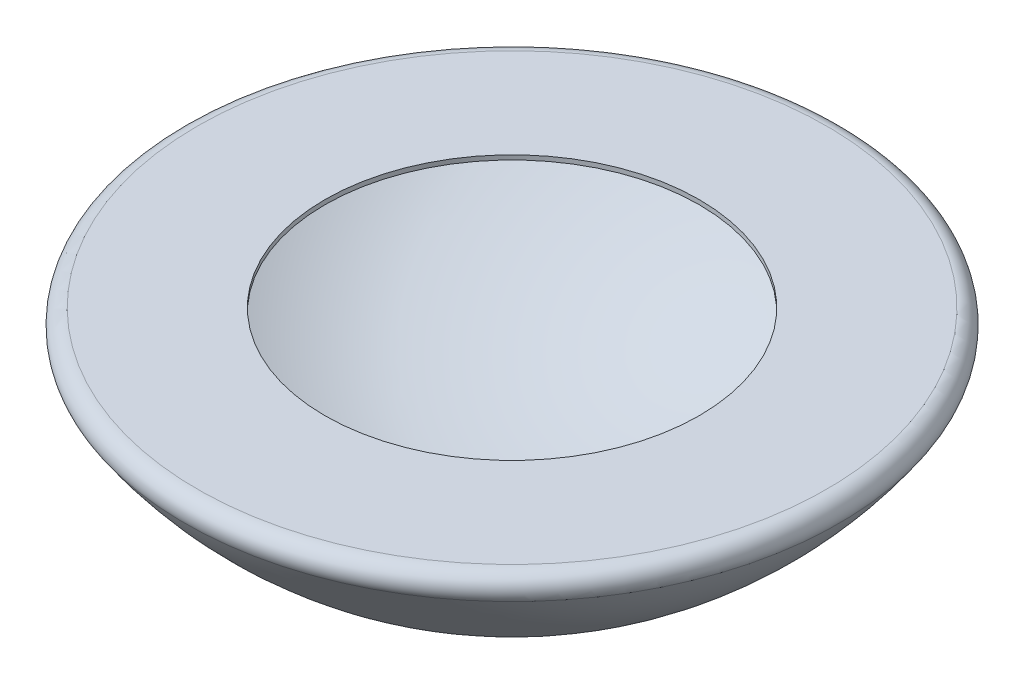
ISO-10303-21;
HEADER;
FILE_DESCRIPTION(('STEP AP214'),'2;1');
FILE_NAME('part.step','',(''),(''),'','','');
FILE_SCHEMA(('AUTOMOTIVE_DESIGN { 1 0 10303 214 1 1 1 1 }'));
ENDSEC;
DATA;
#1=APPLICATION_CONTEXT('core data for automotive mechanical design processes');
#2=APPLICATION_PROTOCOL_DEFINITION('international standard','automotive_design',2000,#1);
#3=PRODUCT_CONTEXT('',#1,'mechanical');
#4=PRODUCT('Part','Part','',(#3));
#5=PRODUCT_RELATED_PRODUCT_CATEGORY('part','',(#4));
#6=PRODUCT_DEFINITION_FORMATION('','',#4);
#7=PRODUCT_DEFINITION_CONTEXT('part definition',#1,'design');
#8=PRODUCT_DEFINITION('design','',#6,#7);
#9=PRODUCT_DEFINITION_SHAPE('','',#8);
#10=(LENGTH_UNIT() NAMED_UNIT(*) SI_UNIT(.MILLI.,.METRE.));
#11=(NAMED_UNIT(*) PLANE_ANGLE_UNIT() SI_UNIT($,.RADIAN.));
#12=(NAMED_UNIT(*) SI_UNIT($,.STERADIAN.) SOLID_ANGLE_UNIT());
#13=UNCERTAINTY_MEASURE_WITH_UNIT(LENGTH_MEASURE(1.E-05),#10,'distance_accuracy_value','');
#14=(GEOMETRIC_REPRESENTATION_CONTEXT(3) GLOBAL_UNCERTAINTY_ASSIGNED_CONTEXT((#13)) GLOBAL_UNIT_ASSIGNED_CONTEXT((#10,
#11,#12)) REPRESENTATION_CONTEXT('',''));
#15=CARTESIAN_POINT('',(0.,0.,0.));
#16=DIRECTION('',(0.,0.,1.));
#17=DIRECTION('',(1.,0.,0.));
#18=AXIS2_PLACEMENT_3D('',#15,#16,#17);
#19=CARTESIAN_POINT('',(-0.28661705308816,12.9984201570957,0.));
#20=DIRECTION('',(0.,0.,-1.));
#21=DIRECTION('',(-1.,0.,0.));
#22=AXIS2_PLACEMENT_3D('',#19,#20,#21);
#23=CIRCLE('',#22,25.7);
#24=TRIMMED_CURVE('',#23,(PARAMETER_VALUE(-1.58194897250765)),
(PARAMETER_VALUE(1.58194897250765)),.T.,.PARAMETER.);
#25=CARTESIAN_POINT('',(0.,12.9984201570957,0.));
#26=DIRECTION('',(0.,1.,0.));
#27=AXIS1_PLACEMENT('',#25,#26);
#28=SURFACE_OF_REVOLUTION('',#24,#27);
#29=CARTESIAN_POINT('',(0.,-12.6999815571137,0.));
#30=VERTEX_POINT('',#29);
#31=VERTEX_LOOP('',#30);
#32=FACE_BOUND('',#31,.T.);
#33=CARTESIAN_POINT('',(0.,-1.3919557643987,0.));
#34=DIRECTION('',(0.,1.,0.));
#35=DIRECTION('',(-1.,0.,0.));
#36=AXIS2_PLACEMENT_3D('',#33,#34,#35);
#37=CIRCLE('',#36,21.5799747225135);
#38=CARTESIAN_POINT('',(-21.5799747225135,-1.3919557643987,0.));
#39=VERTEX_POINT('',#38);
#40=EDGE_CURVE('E49',#39,#39,#37,.T.);
#41=ORIENTED_EDGE('',*,*,#40,.T.);
#42=EDGE_LOOP('',(#41));
#43=FACE_BOUND('',#42,.T.);
#44=ADVANCED_FACE('F31',(#32,#43),#28,.F.);
#45=CARTESIAN_POINT('',(-0.28661705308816,12.9984201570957,0.));
#46=DIRECTION('',(0.,0.,-1.));
#47=DIRECTION('',(-1.,0.,0.));
#48=AXIS2_PLACEMENT_3D('',#45,#46,#47);
#49=CIRCLE('',#48,26.);
#50=TRIMMED_CURVE('',#49,(PARAMETER_VALUE(-1.58182028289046)),
(PARAMETER_VALUE(1.58182028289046)),.T.,.PARAMETER.);
#51=CARTESIAN_POINT('',(0.,12.9984201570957,0.));
#52=DIRECTION('',(0.,1.,0.));
#53=AXIS1_PLACEMENT('',#51,#52);
#54=SURFACE_OF_REVOLUTION('',#50,#53);
#55=CARTESIAN_POINT('',(0.,-1.55993680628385,0.));
#56=DIRECTION('',(0.,1.,0.));
#57=DIRECTION('',(-1.,0.,0.));
#58=AXIS2_PLACEMENT_3D('',#55,#56,#57);
#59=CIRCLE('',#58,21.8285353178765);
#60=CARTESIAN_POINT('',(-21.8285353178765,-1.55993680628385,0.));
#61=VERTEX_POINT('',#60);
#62=EDGE_CURVE('E11',#61,#61,#59,.T.);
#63=ORIENTED_EDGE('',*,*,#62,.F.);
#64=EDGE_LOOP('',(#63));
#65=FACE_BOUND('',#64,.T.);
#66=CARTESIAN_POINT('',(0.,-13.,0.));
#67=VERTEX_POINT('',#66);
#68=VERTEX_LOOP('',#67);
#69=FACE_BOUND('',#68,.T.);
#70=ADVANCED_FACE('F46',(#65,#69),#54,.T.);
#71=CARTESIAN_POINT('',(0.,-1.,0.));
#72=DIRECTION('',(0.,1.,0.));
#73=DIRECTION('',(-1.,0.,0.));
#74=AXIS2_PLACEMENT_3D('',#71,#72,#73);
#75=TOROIDAL_SURFACE('',#74,21.,1.);
#76=CARTESIAN_POINT('',(0.,0.,0.));
#77=DIRECTION('',(0.,1.,0.));
#78=DIRECTION('',(-1.,0.,0.));
#79=AXIS2_PLACEMENT_3D('',#76,#77,#78);
#80=CIRCLE('',#79,21.);
#81=CARTESIAN_POINT('',(-21.,0.,0.));
#82=VERTEX_POINT('',#81);
#83=EDGE_CURVE('E38',#82,#82,#80,.T.);
#84=ORIENTED_EDGE('',*,*,#83,.F.);
#85=EDGE_LOOP('',(#84));
#86=FACE_BOUND('',#85,.T.);
#87=ORIENTED_EDGE('',*,*,#62,.T.);
#88=EDGE_LOOP('',(#87));
#89=FACE_BOUND('',#88,.T.);
#90=ADVANCED_FACE('F66',(#86,#89),#75,.T.);
#91=CARTESIAN_POINT('',(21.,0.,0.));
#92=DIRECTION('',(0.,-1.,0.));
#93=DIRECTION('',(1.,0.,0.));
#94=AXIS2_PLACEMENT_3D('',#91,#92,#93);
#95=PLANE('',#94);
#96=CARTESIAN_POINT('',(0.,0.,0.));
#97=DIRECTION('',(0.,1.,0.));
#98=DIRECTION('',(-1.,0.,0.));
#99=AXIS2_PLACEMENT_3D('',#96,#97,#98);
#100=CIRCLE('',#99,12.4950429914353);
#101=CARTESIAN_POINT('',(-12.4950429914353,0.,0.));
#102=VERTEX_POINT('',#101);
#103=EDGE_CURVE('E59',#102,#102,#100,.T.);
#104=ORIENTED_EDGE('',*,*,#103,.F.);
#105=EDGE_LOOP('',(#104));
#106=FACE_BOUND('',#105,.T.);
#107=ORIENTED_EDGE('',*,*,#83,.T.);
#108=EDGE_LOOP('',(#107));
#109=FACE_BOUND('',#108,.T.);
#110=ADVANCED_FACE('F64',(#106,#109),#95,.F.);
#111=CARTESIAN_POINT('',(0.,4.28071797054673,0.));
#112=DIRECTION('',(0.,1.,0.));
#113=DIRECTION('',(-1.,0.,0.));
#114=AXIS2_PLACEMENT_3D('',#111,#112,#113);
#115=CYLINDRICAL_SURFACE('',#114,12.4950429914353);
#116=CARTESIAN_POINT('',(0.,-0.300000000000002,0.));
#117=DIRECTION('',(0.,1.,0.));
#118=DIRECTION('',(-1.,0.,0.));
#119=AXIS2_PLACEMENT_3D('',#116,#117,#118);
#120=CIRCLE('',#119,12.4950429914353);
#121=CARTESIAN_POINT('',(-12.4950429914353,-0.300000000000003,0.));
#122=VERTEX_POINT('',#121);
#123=EDGE_CURVE('E54',#122,#122,#120,.T.);
#124=ORIENTED_EDGE('',*,*,#123,.F.);
#125=EDGE_LOOP('',(#124));
#126=FACE_BOUND('',#125,.T.);
#127=ORIENTED_EDGE('',*,*,#103,.T.);
#128=EDGE_LOOP('',(#127));
#129=FACE_BOUND('',#128,.T.);
#130=ADVANCED_FACE('F78',(#126,#129),#115,.F.);
#131=CARTESIAN_POINT('',(21.,-0.299999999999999,0.));
#132=DIRECTION('',(0.,1.,0.));
#133=DIRECTION('',(-1.,0.,0.));
#134=AXIS2_PLACEMENT_3D('',#131,#132,#133);
#135=PLANE('',#134);
#136=CARTESIAN_POINT('',(0.,-0.300000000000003,0.));
#137=DIRECTION('',(0.,1.,0.));
#138=DIRECTION('',(-1.,0.,0.));
#139=AXIS2_PLACEMENT_3D('',#136,#137,#138);
#140=CIRCLE('',#139,21.);
#141=CARTESIAN_POINT('',(-21.,-0.300000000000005,0.));
#142=VERTEX_POINT('',#141);
#143=EDGE_CURVE('E51',#142,#142,#140,.T.);
#144=ORIENTED_EDGE('',*,*,#143,.F.);
#145=EDGE_LOOP('',(#144));
#146=FACE_BOUND('',#145,.T.);
#147=ORIENTED_EDGE('',*,*,#123,.T.);
#148=EDGE_LOOP('',(#147));
#149=FACE_BOUND('',#148,.T.);
#150=ADVANCED_FACE('F82',(#146,#149),#135,.F.);
#151=CARTESIAN_POINT('',(0.,-1.,0.));
#152=DIRECTION('',(0.,1.,0.));
#153=DIRECTION('',(-1.,0.,0.));
#154=AXIS2_PLACEMENT_3D('',#151,#152,#153);
#155=TOROIDAL_SURFACE('',#154,21.,0.700000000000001);
#156=ORIENTED_EDGE('',*,*,#40,.F.);
#157=EDGE_LOOP('',(#156));
#158=FACE_BOUND('',#157,.T.);
#159=ORIENTED_EDGE('',*,*,#143,.T.);
#160=EDGE_LOOP('',(#159));
#161=FACE_BOUND('',#160,.T.);
#162=ADVANCED_FACE('F86',(#158,#161),#155,.F.);
#163=CLOSED_SHELL('',(#44,#70,#90,#110,#130,#150,#162));
#164=MANIFOLD_SOLID_BREP('B2',#163);
#165=ADVANCED_BREP_SHAPE_REPRESENTATION('',(#18,#164),#14);
#166=SHAPE_DEFINITION_REPRESENTATION(#9,#165);
ENDSEC;
END-ISO-10303-21;
